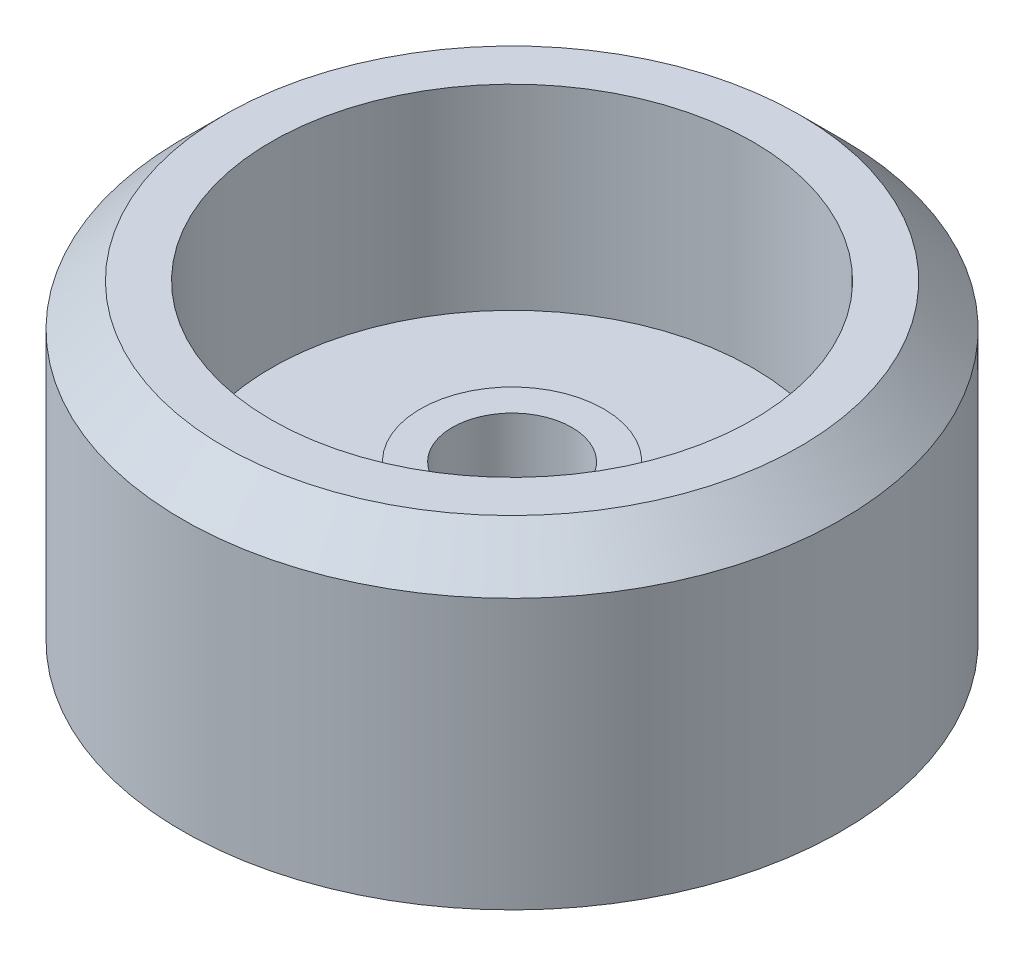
from build123d import *


with BuildPart() as part:
    # Esquisse1 → R_volution1 (revolve)
    with BuildSketch(Plane.XY, mode=Mode.PRIVATE) as r_volution1_sk:
        Polygon((14.972614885, -29.063461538), (82.589647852, -29.063461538), (82.589647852, 38.553571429), (72.061557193, 49.081662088), (60.347202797, 49.081662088), (60.347202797, 0), (22.979895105, 0), (22.979895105, 9.786675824), (14.972614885, 9.786675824), align=None)
    revolve(r_volution1_sk.sketch.rotate(Axis((0, -39.443269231, 0), (0, 1, 0)), 90), axis=Axis((0, -39.443269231, 0), (0, 1, 0)))


solid = part.part
